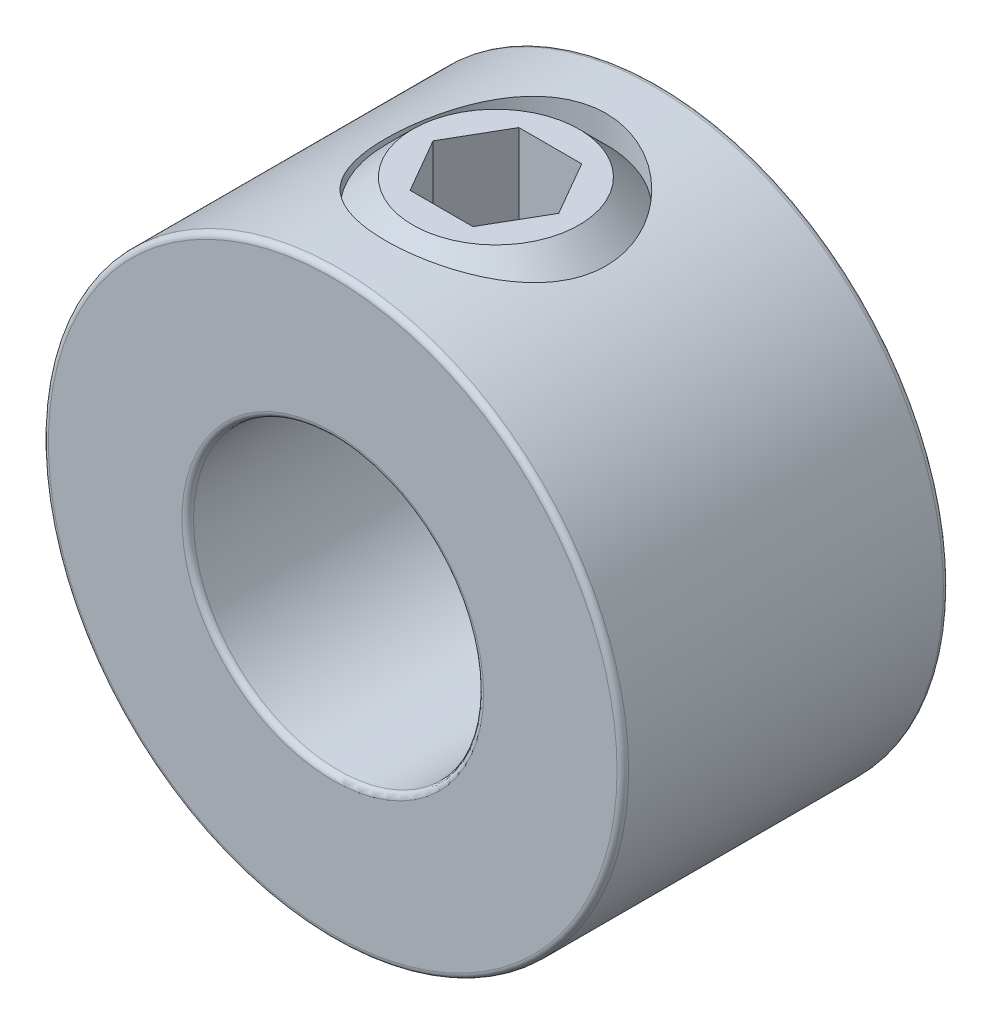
from build123d import *

# Parameters (mm, degrees)
SKETCH1_R          = 6.35
SKETCH1_R_2        = 3.175
EXTRUDE1_DEPTH     = 3.571875
SKETCH2_R          = 2.413
CUT_EXTRUDE1_DEPTH = 49.179055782
FILLET1_R          = 0.127
CUT_EXTRUDE2_DEPTH = 2.38125


with BuildPart() as part:
    # Sketch1 → Extrude1 (new, symmetric)
    with BuildSketch(Plane.XY):
        Circle(SKETCH1_R)
        Circle(SKETCH1_R_2, mode=Mode.SUBTRACT)
    extrude(amount=EXTRUDE1_DEPTH, both=True)

    # Sketch2 → Cut-Extrude1 (cut, through all)
    with BuildSketch(Plane(origin=(41.275, 0, 0), x_dir=(0, 0, -1), z_dir=(0, -1, 0))):
        with Locations((0, -41.275)):
            Circle(SKETCH2_R)
    extrude(amount=-CUT_EXTRUDE1_DEPTH, mode=Mode.SUBTRACT)

    # Fillet1
    fillet1_edges = [part.edges().sort_by_distance(p)[0] for p in [
        (-6.35, 0, -3.571875),
        (-6.35, 0, 3.571875),
        (-3.175, 0, -3.571875),
        (-3.175, 0, 3.571875),
    ]]
    fillet(fillet1_edges, radius=FILLET1_R)


with BuildPart() as body_2:
    # Sketch3 → Revolve1 (revolve)
    with BuildSketch(Plane.XY):
        Polygon((-1.819751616, 3.175), (-0.71189806, 3.175), (0, 3.88689806), (0, 6.35), (-1.819751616, 6.35), (-2.413, 5.756751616), (-2.413, 3.768248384), align=None)
    revolve(axis=Axis((0, 3.175, 0), (0, -1, 0)))

    # Sketch4 → Cut-Extrude2 (cut)
    with BuildSketch(Plane(origin=(3.3734375, 6.35, 0), x_dir=(0, 0, -1), z_dir=(0, -1, 0))):
        Polygon((0, -1.998622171), (-1.190625, -2.686029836), (-1.190625, -4.060845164), (0, -4.748252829), (1.190625, -4.060845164), (1.190625, -2.686029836), align=None)
    extrude(amount=CUT_EXTRUDE2_DEPTH, mode=Mode.SUBTRACT)


solid = Compound([part.part, body_2.part])
